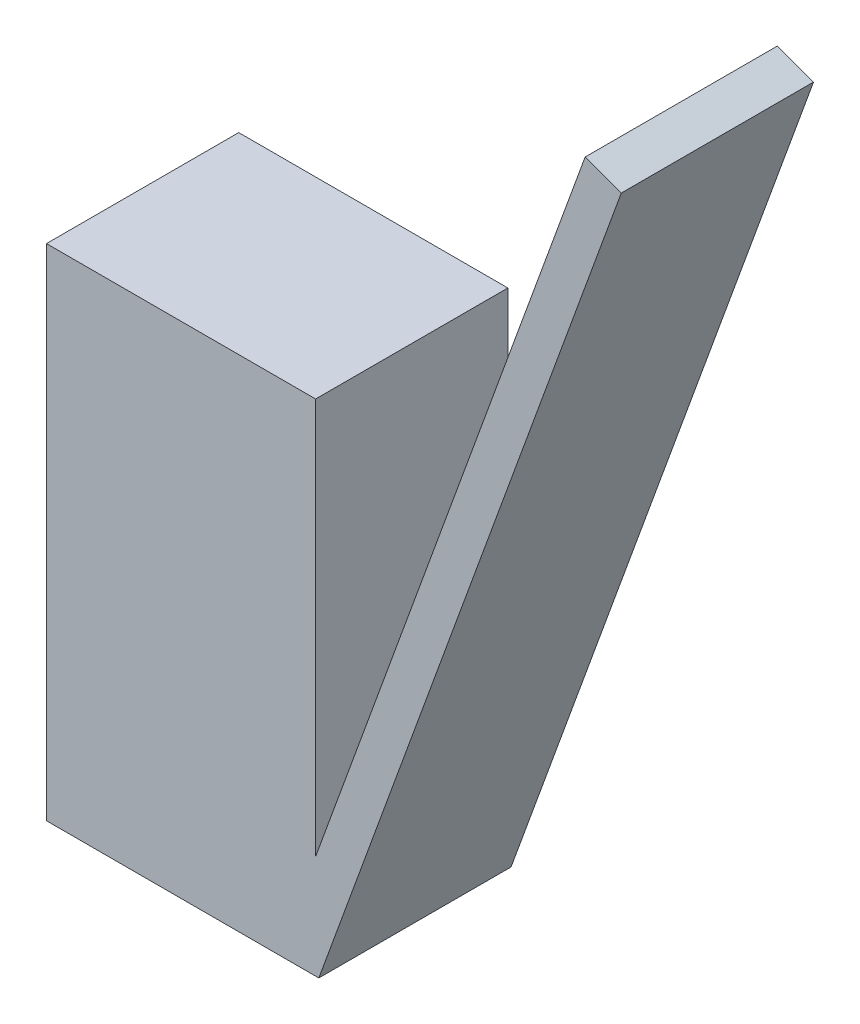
from build123d import *

# Parameters (mm, degrees)
BASE_EXTRUSION_DEPTH = 5


with BuildPart() as part:
    # Esquisse1 → Base-Extrusion (new body)
    with BuildSketch(Plane.XY):
        Polygon((0, 0), (7.866463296, 21.612930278), (6.926770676, 21.954950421), (-0.082976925, 2.695827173), (-0.082976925, 13), (-7.082976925, 13), (-7.082976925, 0), align=None)
    extrude(amount=BASE_EXTRUSION_DEPTH)


solid = part.part
